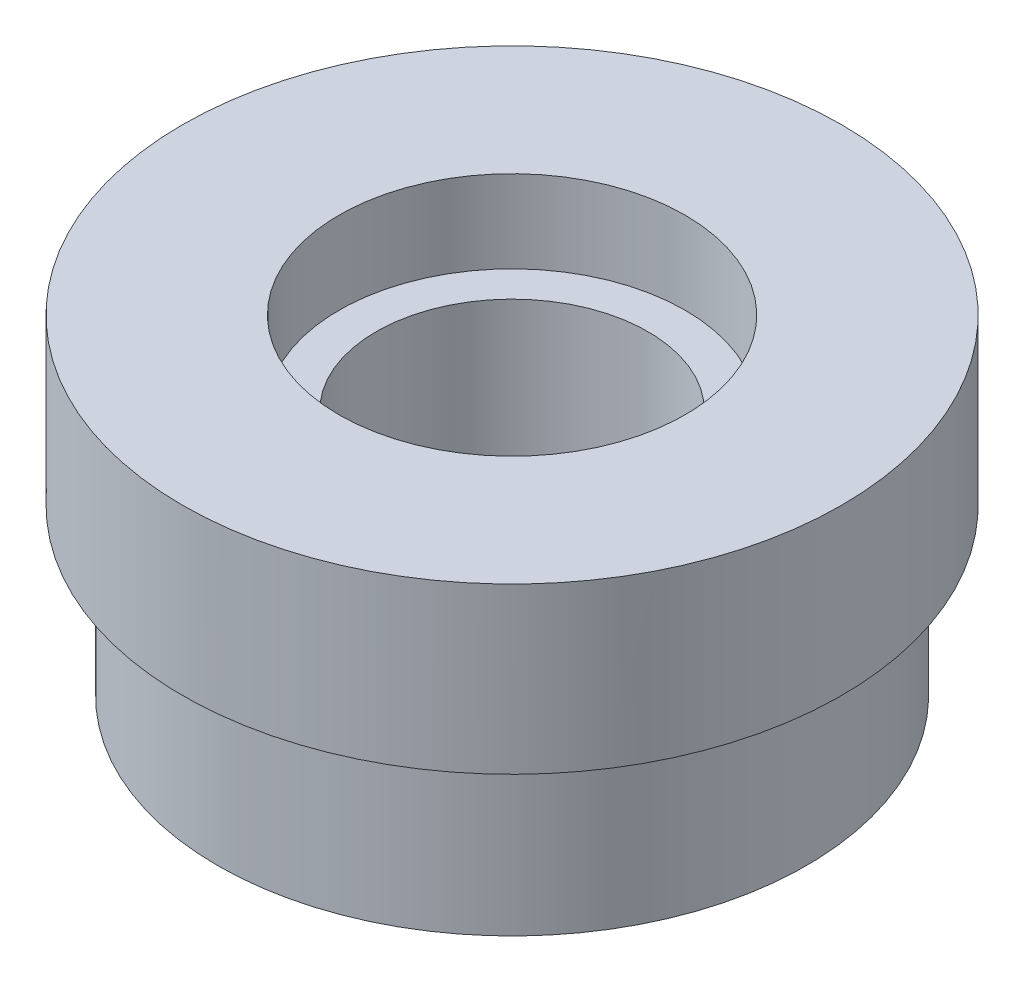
ISO-10303-21;
HEADER;
FILE_DESCRIPTION(('STEP AP214'),'2;1');
FILE_NAME('part.step','',(''),(''),'','','');
FILE_SCHEMA(('AUTOMOTIVE_DESIGN { 1 0 10303 214 1 1 1 1 }'));
ENDSEC;
DATA;
#1=APPLICATION_CONTEXT('core data for automotive mechanical design processes');
#2=APPLICATION_PROTOCOL_DEFINITION('international standard','automotive_design',2000,#1);
#3=PRODUCT_CONTEXT('',#1,'mechanical');
#4=PRODUCT('Part','Part','',(#3));
#5=PRODUCT_RELATED_PRODUCT_CATEGORY('part','',(#4));
#6=PRODUCT_DEFINITION_FORMATION('','',#4);
#7=PRODUCT_DEFINITION_CONTEXT('part definition',#1,'design');
#8=PRODUCT_DEFINITION('design','',#6,#7);
#9=PRODUCT_DEFINITION_SHAPE('','',#8);
#10=(LENGTH_UNIT() NAMED_UNIT(*) SI_UNIT(.MILLI.,.METRE.));
#11=(NAMED_UNIT(*) PLANE_ANGLE_UNIT() SI_UNIT($,.RADIAN.));
#12=(NAMED_UNIT(*) SI_UNIT($,.STERADIAN.) SOLID_ANGLE_UNIT());
#13=UNCERTAINTY_MEASURE_WITH_UNIT(LENGTH_MEASURE(1.E-05),#10,'distance_accuracy_value','');
#14=(GEOMETRIC_REPRESENTATION_CONTEXT(3) GLOBAL_UNCERTAINTY_ASSIGNED_CONTEXT((#13)) GLOBAL_UNIT_ASSIGNED_CONTEXT((#10,
#11,#12)) REPRESENTATION_CONTEXT('',''));
#15=CARTESIAN_POINT('',(0.,0.,0.));
#16=DIRECTION('',(0.,0.,1.));
#17=DIRECTION('',(1.,0.,0.));
#18=AXIS2_PLACEMENT_3D('',#15,#16,#17);
#19=CARTESIAN_POINT('',(0.,0.,0.));
#20=DIRECTION('',(0.,1.,0.));
#21=DIRECTION('',(0.,0.,1.));
#22=AXIS2_PLACEMENT_3D('',#19,#20,#21);
#23=PLANE('',#22);
#24=CARTESIAN_POINT('',(0.,0.,0.));
#25=DIRECTION('',(0.,1.,0.));
#26=DIRECTION('',(0.,0.,1.));
#27=AXIS2_PLACEMENT_3D('',#24,#25,#26);
#28=CIRCLE('',#27,16.5);
#29=CARTESIAN_POINT('',(0.,0.,16.5));
#30=VERTEX_POINT('',#29);
#31=EDGE_CURVE('E41',#30,#30,#28,.T.);
#32=ORIENTED_EDGE('',*,*,#31,.T.);
#33=EDGE_LOOP('',(#32));
#34=FACE_BOUND('',#33,.T.);
#35=CARTESIAN_POINT('',(0.,0.,0.));
#36=DIRECTION('',(0.,-1.,0.));
#37=DIRECTION('',(0.,0.,-1.));
#38=AXIS2_PLACEMENT_3D('',#35,#36,#37);
#39=CIRCLE('',#38,35.75);
#40=CARTESIAN_POINT('',(0.,0.,-35.75));
#41=VERTEX_POINT('',#40);
#42=EDGE_CURVE('E60',#41,#41,#39,.T.);
#43=ORIENTED_EDGE('',*,*,#42,.T.);
#44=EDGE_LOOP('',(#43));
#45=FACE_BOUND('',#44,.T.);
#46=ADVANCED_FACE('F33',(#34,#45),#23,.F.);
#47=CARTESIAN_POINT('',(0.,40.,0.));
#48=DIRECTION('',(0.,-1.,0.));
#49=DIRECTION('',(0.,0.,-1.));
#50=AXIS2_PLACEMENT_3D('',#47,#48,#49);
#51=CYLINDRICAL_SURFACE('',#50,40.);
#52=CARTESIAN_POINT('',(0.,40.,0.));
#53=DIRECTION('',(0.,1.,0.));
#54=DIRECTION('',(0.,0.,1.));
#55=AXIS2_PLACEMENT_3D('',#52,#53,#54);
#56=CIRCLE('',#55,40.);
#57=CARTESIAN_POINT('',(0.,40.,40.));
#58=VERTEX_POINT('',#57);
#59=EDGE_CURVE('E11',#58,#58,#56,.T.);
#60=ORIENTED_EDGE('',*,*,#59,.F.);
#61=EDGE_LOOP('',(#60));
#62=FACE_BOUND('',#61,.T.);
#63=CARTESIAN_POINT('',(0.,20.,0.));
#64=DIRECTION('',(0.,-1.,0.));
#65=DIRECTION('',(0.,0.,-1.));
#66=AXIS2_PLACEMENT_3D('',#63,#64,#65);
#67=CIRCLE('',#66,40.);
#68=CARTESIAN_POINT('',(0.,20.,-40.));
#69=VERTEX_POINT('',#68);
#70=EDGE_CURVE('E37',#69,#69,#67,.T.);
#71=ORIENTED_EDGE('',*,*,#70,.F.);
#72=EDGE_LOOP('',(#71));
#73=FACE_BOUND('',#72,.T.);
#74=ADVANCED_FACE('F35',(#62,#73),#51,.T.);
#75=CARTESIAN_POINT('',(0.,40.,0.));
#76=DIRECTION('',(0.,-1.,0.));
#77=DIRECTION('',(0.,0.,-1.));
#78=AXIS2_PLACEMENT_3D('',#75,#76,#77);
#79=CYLINDRICAL_SURFACE('',#78,16.5);
#80=ORIENTED_EDGE('',*,*,#31,.F.);
#81=EDGE_LOOP('',(#80));
#82=FACE_BOUND('',#81,.T.);
#83=CARTESIAN_POINT('',(0.,30.,0.));
#84=DIRECTION('',(0.,1.,0.));
#85=DIRECTION('',(0.,0.,1.));
#86=AXIS2_PLACEMENT_3D('',#83,#84,#85);
#87=CIRCLE('',#86,16.5);
#88=CARTESIAN_POINT('',(0.,30.,16.5));
#89=VERTEX_POINT('',#88);
#90=EDGE_CURVE('E46',#89,#89,#87,.T.);
#91=ORIENTED_EDGE('',*,*,#90,.T.);
#92=EDGE_LOOP('',(#91));
#93=FACE_BOUND('',#92,.T.);
#94=ADVANCED_FACE('F73',(#82,#93),#79,.F.);
#95=CARTESIAN_POINT('',(0.,40.,0.));
#96=DIRECTION('',(0.,1.,0.));
#97=DIRECTION('',(0.,0.,1.));
#98=AXIS2_PLACEMENT_3D('',#95,#96,#97);
#99=PLANE('',#98);
#100=CARTESIAN_POINT('',(0.,40.,0.));
#101=DIRECTION('',(0.,1.,0.));
#102=DIRECTION('',(0.,0.,1.));
#103=AXIS2_PLACEMENT_3D('',#100,#101,#102);
#104=CIRCLE('',#103,21.);
#105=CARTESIAN_POINT('',(0.,40.,21.));
#106=VERTEX_POINT('',#105);
#107=EDGE_CURVE('E54',#106,#106,#104,.T.);
#108=ORIENTED_EDGE('',*,*,#107,.F.);
#109=EDGE_LOOP('',(#108));
#110=FACE_BOUND('',#109,.T.);
#111=ORIENTED_EDGE('',*,*,#59,.T.);
#112=EDGE_LOOP('',(#111));
#113=FACE_BOUND('',#112,.T.);
#114=ADVANCED_FACE('F79',(#110,#113),#99,.T.);
#115=CARTESIAN_POINT('',(0.,30.,0.));
#116=DIRECTION('',(0.,1.,0.));
#117=DIRECTION('',(0.,0.,1.));
#118=AXIS2_PLACEMENT_3D('',#115,#116,#117);
#119=CYLINDRICAL_SURFACE('',#118,21.);
#120=CARTESIAN_POINT('',(0.,30.,0.));
#121=DIRECTION('',(0.,1.,0.));
#122=DIRECTION('',(0.,0.,1.));
#123=AXIS2_PLACEMENT_3D('',#120,#121,#122);
#124=CIRCLE('',#123,21.);
#125=CARTESIAN_POINT('',(0.,30.,21.));
#126=VERTEX_POINT('',#125);
#127=EDGE_CURVE('E50',#126,#126,#124,.T.);
#128=ORIENTED_EDGE('',*,*,#127,.F.);
#129=EDGE_LOOP('',(#128));
#130=FACE_BOUND('',#129,.T.);
#131=ORIENTED_EDGE('',*,*,#107,.T.);
#132=EDGE_LOOP('',(#131));
#133=FACE_BOUND('',#132,.T.);
#134=ADVANCED_FACE('F88',(#130,#133),#119,.F.);
#135=CARTESIAN_POINT('',(0.,30.,0.));
#136=DIRECTION('',(0.,1.,0.));
#137=DIRECTION('',(0.,0.,1.));
#138=AXIS2_PLACEMENT_3D('',#135,#136,#137);
#139=PLANE('',#138);
#140=ORIENTED_EDGE('',*,*,#90,.F.);
#141=EDGE_LOOP('',(#140));
#142=FACE_BOUND('',#141,.T.);
#143=ORIENTED_EDGE('',*,*,#127,.T.);
#144=EDGE_LOOP('',(#143));
#145=FACE_BOUND('',#144,.T.);
#146=ADVANCED_FACE('F93',(#142,#145),#139,.T.);
#147=CARTESIAN_POINT('',(0.,20.,0.));
#148=DIRECTION('',(0.,-1.,0.));
#149=DIRECTION('',(0.,0.,-1.));
#150=AXIS2_PLACEMENT_3D('',#147,#148,#149);
#151=PLANE('',#150);
#152=CARTESIAN_POINT('',(0.,20.,0.));
#153=DIRECTION('',(0.,-1.,0.));
#154=DIRECTION('',(0.,0.,-1.));
#155=AXIS2_PLACEMENT_3D('',#152,#153,#154);
#156=CIRCLE('',#155,35.75);
#157=CARTESIAN_POINT('',(0.,20.,-35.75));
#158=VERTEX_POINT('',#157);
#159=EDGE_CURVE('E63',#158,#158,#156,.T.);
#160=ORIENTED_EDGE('',*,*,#159,.F.);
#161=EDGE_LOOP('',(#160));
#162=FACE_BOUND('',#161,.T.);
#163=ORIENTED_EDGE('',*,*,#70,.T.);
#164=EDGE_LOOP('',(#163));
#165=FACE_BOUND('',#164,.T.);
#166=ADVANCED_FACE('F70',(#162,#165),#151,.T.);
#167=CARTESIAN_POINT('',(0.,20.,0.));
#168=DIRECTION('',(0.,-1.,0.));
#169=DIRECTION('',(0.,0.,-1.));
#170=AXIS2_PLACEMENT_3D('',#167,#168,#169);
#171=CYLINDRICAL_SURFACE('',#170,35.75);
#172=ORIENTED_EDGE('',*,*,#159,.T.);
#173=EDGE_LOOP('',(#172));
#174=FACE_BOUND('',#173,.T.);
#175=ORIENTED_EDGE('',*,*,#42,.F.);
#176=EDGE_LOOP('',(#175));
#177=FACE_BOUND('',#176,.T.);
#178=ADVANCED_FACE('F100',(#174,#177),#171,.T.);
#179=CLOSED_SHELL('',(#46,#74,#94,#114,#134,#146,#166,#178));
#180=MANIFOLD_SOLID_BREP('B2',#179);
#181=ADVANCED_BREP_SHAPE_REPRESENTATION('',(#18,#180),#14);
#182=SHAPE_DEFINITION_REPRESENTATION(#9,#181);
ENDSEC;
END-ISO-10303-21;
